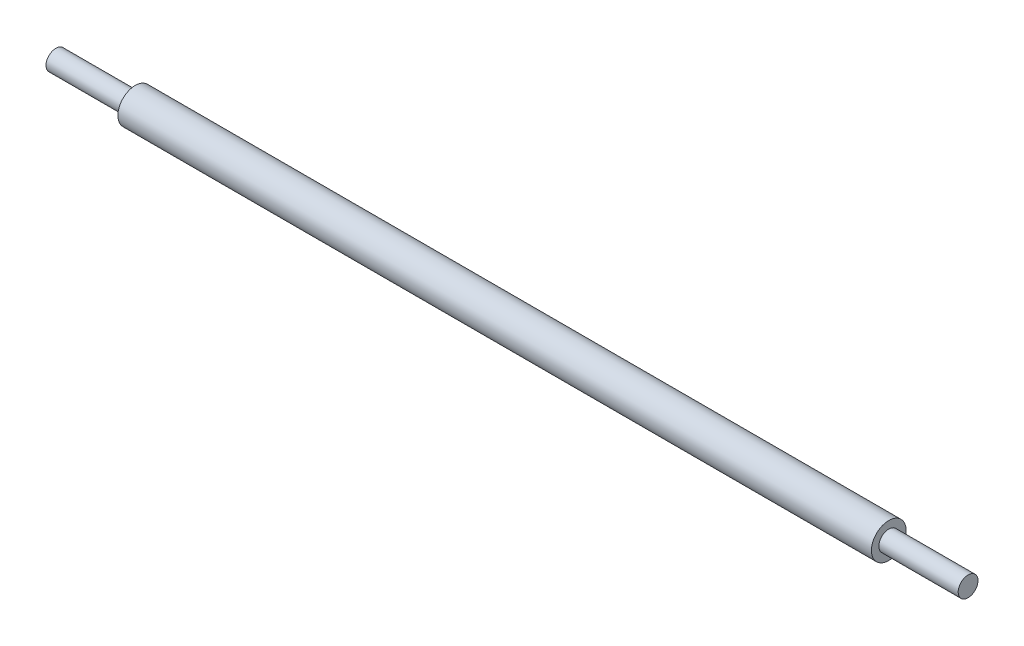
ISO-10303-21;
HEADER;
FILE_DESCRIPTION(('STEP AP214'),'2;1');
FILE_NAME('part.step','',(''),(''),'','','');
FILE_SCHEMA(('AUTOMOTIVE_DESIGN { 1 0 10303 214 1 1 1 1 }'));
ENDSEC;
DATA;
#1=APPLICATION_CONTEXT('core data for automotive mechanical design processes');
#2=APPLICATION_PROTOCOL_DEFINITION('international standard','automotive_design',2000,#1);
#3=PRODUCT_CONTEXT('',#1,'mechanical');
#4=PRODUCT('Part','Part','',(#3));
#5=PRODUCT_RELATED_PRODUCT_CATEGORY('part','',(#4));
#6=PRODUCT_DEFINITION_FORMATION('','',#4);
#7=PRODUCT_DEFINITION_CONTEXT('part definition',#1,'design');
#8=PRODUCT_DEFINITION('design','',#6,#7);
#9=PRODUCT_DEFINITION_SHAPE('','',#8);
#10=(LENGTH_UNIT() NAMED_UNIT(*) SI_UNIT(.MILLI.,.METRE.));
#11=(NAMED_UNIT(*) PLANE_ANGLE_UNIT() SI_UNIT($,.RADIAN.));
#12=(NAMED_UNIT(*) SI_UNIT($,.STERADIAN.) SOLID_ANGLE_UNIT());
#13=UNCERTAINTY_MEASURE_WITH_UNIT(LENGTH_MEASURE(1.E-05),#10,'distance_accuracy_value','');
#14=(GEOMETRIC_REPRESENTATION_CONTEXT(3) GLOBAL_UNCERTAINTY_ASSIGNED_CONTEXT((#13)) GLOBAL_UNIT_ASSIGNED_CONTEXT((#10,
#11,#12)) REPRESENTATION_CONTEXT('',''));
#15=CARTESIAN_POINT('',(0.,0.,0.));
#16=DIRECTION('',(0.,0.,1.));
#17=DIRECTION('',(1.,0.,0.));
#18=AXIS2_PLACEMENT_3D('',#15,#16,#17);
#19=CARTESIAN_POINT('',(-460.,-1.60839482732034E-13,0.));
#20=DIRECTION('',(-1.,0.,0.));
#21=DIRECTION('',(0.,-1.,0.));
#22=AXIS2_PLACEMENT_3D('',#19,#20,#21);
#23=PLANE('',#22);
#24=CARTESIAN_POINT('',(-460.,-1.60839482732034E-13,0.));
#25=DIRECTION('',(1.,0.,0.));
#26=DIRECTION('',(0.,1.,0.));
#27=AXIS2_PLACEMENT_3D('',#24,#25,#26);
#28=CIRCLE('',#27,10.);
#29=CARTESIAN_POINT('',(-460.,9.99999999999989,0.));
#30=VERTEX_POINT('',#29);
#31=EDGE_CURVE('E10',#30,#30,#28,.T.);
#32=ORIENTED_EDGE('',*,*,#31,.F.);
#33=EDGE_LOOP('',(#32));
#34=FACE_BOUND('',#33,.T.);
#35=ADVANCED_FACE('F38',(#34),#23,.T.);
#36=CARTESIAN_POINT('',(-460.,-1.60839482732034E-13,0.));
#37=DIRECTION('',(1.,0.,0.));
#38=DIRECTION('',(0.,1.,0.));
#39=AXIS2_PLACEMENT_3D('',#36,#37,#38);
#40=CYLINDRICAL_SURFACE('',#39,10.);
#41=ORIENTED_EDGE('',*,*,#31,.T.);
#42=EDGE_LOOP('',(#41));
#43=FACE_BOUND('',#42,.T.);
#44=CARTESIAN_POINT('',(-380.,-1.60685780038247E-13,0.));
#45=DIRECTION('',(1.,0.,0.));
#46=DIRECTION('',(0.,1.,0.));
#47=AXIS2_PLACEMENT_3D('',#44,#45,#46);
#48=CIRCLE('',#47,10.);
#49=CARTESIAN_POINT('',(-380.,9.99999999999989,0.));
#50=VERTEX_POINT('',#49);
#51=EDGE_CURVE('E45',#50,#50,#48,.T.);
#52=ORIENTED_EDGE('',*,*,#51,.F.);
#53=EDGE_LOOP('',(#52));
#54=FACE_BOUND('',#53,.T.);
#55=ADVANCED_FACE('F86',(#43,#54),#40,.T.);
#56=CARTESIAN_POINT('',(-380.,9.99999999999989,0.));
#57=DIRECTION('',(-1.,0.,0.));
#58=DIRECTION('',(0.,-1.,0.));
#59=AXIS2_PLACEMENT_3D('',#56,#57,#58);
#60=PLANE('',#59);
#61=ORIENTED_EDGE('',*,*,#51,.T.);
#62=EDGE_LOOP('',(#61));
#63=FACE_BOUND('',#62,.T.);
#64=CARTESIAN_POINT('',(-380.,-1.60685780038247E-13,0.));
#65=DIRECTION('',(1.,0.,0.));
#66=DIRECTION('',(0.,1.,0.));
#67=AXIS2_PLACEMENT_3D('',#64,#65,#66);
#68=CIRCLE('',#67,17.5000000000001);
#69=CARTESIAN_POINT('',(-380.,17.4999999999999,0.));
#70=VERTEX_POINT('',#69);
#71=EDGE_CURVE('E52',#70,#70,#68,.T.);
#72=ORIENTED_EDGE('',*,*,#71,.F.);
#73=EDGE_LOOP('',(#72));
#74=FACE_BOUND('',#73,.T.);
#75=ADVANCED_FACE('F91',(#63,#74),#60,.T.);
#76=CARTESIAN_POINT('',(-460.,-1.60839482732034E-13,0.));
#77=DIRECTION('',(1.,0.,0.));
#78=DIRECTION('',(0.,1.,0.));
#79=AXIS2_PLACEMENT_3D('',#76,#77,#78);
#80=CYLINDRICAL_SURFACE('',#79,17.5000000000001);
#81=ORIENTED_EDGE('',*,*,#71,.T.);
#82=EDGE_LOOP('',(#81));
#83=FACE_BOUND('',#82,.T.);
#84=CARTESIAN_POINT('',(380.,-1.59225604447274E-13,0.));
#85=DIRECTION('',(1.,0.,0.));
#86=DIRECTION('',(0.,1.,0.));
#87=AXIS2_PLACEMENT_3D('',#84,#85,#86);
#88=CIRCLE('',#87,17.5000000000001);
#89=CARTESIAN_POINT('',(380.,17.4999999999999,0.));
#90=VERTEX_POINT('',#89);
#91=EDGE_CURVE('E57',#90,#90,#88,.T.);
#92=ORIENTED_EDGE('',*,*,#91,.F.);
#93=EDGE_LOOP('',(#92));
#94=FACE_BOUND('',#93,.T.);
#95=ADVANCED_FACE('F82',(#83,#94),#80,.T.);
#96=CARTESIAN_POINT('',(380.,17.4999999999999,0.));
#97=DIRECTION('',(1.,0.,0.));
#98=DIRECTION('',(0.,1.,0.));
#99=AXIS2_PLACEMENT_3D('',#96,#97,#98);
#100=PLANE('',#99);
#101=ORIENTED_EDGE('',*,*,#91,.T.);
#102=EDGE_LOOP('',(#101));
#103=FACE_BOUND('',#102,.T.);
#104=CARTESIAN_POINT('',(380.,-1.59225604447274E-13,0.));
#105=DIRECTION('',(1.,0.,0.));
#106=DIRECTION('',(0.,1.,0.));
#107=AXIS2_PLACEMENT_3D('',#104,#105,#106);
#108=CIRCLE('',#107,10.);
#109=CARTESIAN_POINT('',(380.,9.99999999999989,0.));
#110=VERTEX_POINT('',#109);
#111=EDGE_CURVE('E63',#110,#110,#108,.T.);
#112=ORIENTED_EDGE('',*,*,#111,.F.);
#113=EDGE_LOOP('',(#112));
#114=FACE_BOUND('',#113,.T.);
#115=ADVANCED_FACE('F74',(#103,#114),#100,.T.);
#116=CARTESIAN_POINT('',(-460.,-1.60839482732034E-13,0.));
#117=DIRECTION('',(1.,0.,0.));
#118=DIRECTION('',(0.,1.,0.));
#119=AXIS2_PLACEMENT_3D('',#116,#117,#118);
#120=CYLINDRICAL_SURFACE('',#119,10.);
#121=ORIENTED_EDGE('',*,*,#111,.T.);
#122=EDGE_LOOP('',(#121));
#123=FACE_BOUND('',#122,.T.);
#124=CARTESIAN_POINT('',(460.,-1.59071901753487E-13,0.));
#125=DIRECTION('',(1.,0.,0.));
#126=DIRECTION('',(0.,1.,0.));
#127=AXIS2_PLACEMENT_3D('',#124,#125,#126);
#128=CIRCLE('',#127,10.);
#129=CARTESIAN_POINT('',(460.,9.99999999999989,0.));
#130=VERTEX_POINT('',#129);
#131=EDGE_CURVE('E66',#130,#130,#128,.T.);
#132=ORIENTED_EDGE('',*,*,#131,.F.);
#133=EDGE_LOOP('',(#132));
#134=FACE_BOUND('',#133,.T.);
#135=ADVANCED_FACE('F72',(#123,#134),#120,.T.);
#136=CARTESIAN_POINT('',(460.,9.99999999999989,0.));
#137=DIRECTION('',(1.,0.,0.));
#138=DIRECTION('',(0.,1.,0.));
#139=AXIS2_PLACEMENT_3D('',#136,#137,#138);
#140=PLANE('',#139);
#141=ORIENTED_EDGE('',*,*,#131,.T.);
#142=EDGE_LOOP('',(#141));
#143=FACE_BOUND('',#142,.T.);
#144=ADVANCED_FACE('F70',(#143),#140,.T.);
#145=CLOSED_SHELL('',(#35,#55,#75,#95,#115,#135,#144));
#146=MANIFOLD_SOLID_BREP('B2',#145);
#147=ADVANCED_BREP_SHAPE_REPRESENTATION('',(#18,#146),#14);
#148=SHAPE_DEFINITION_REPRESENTATION(#9,#147);
ENDSEC;
END-ISO-10303-21;
